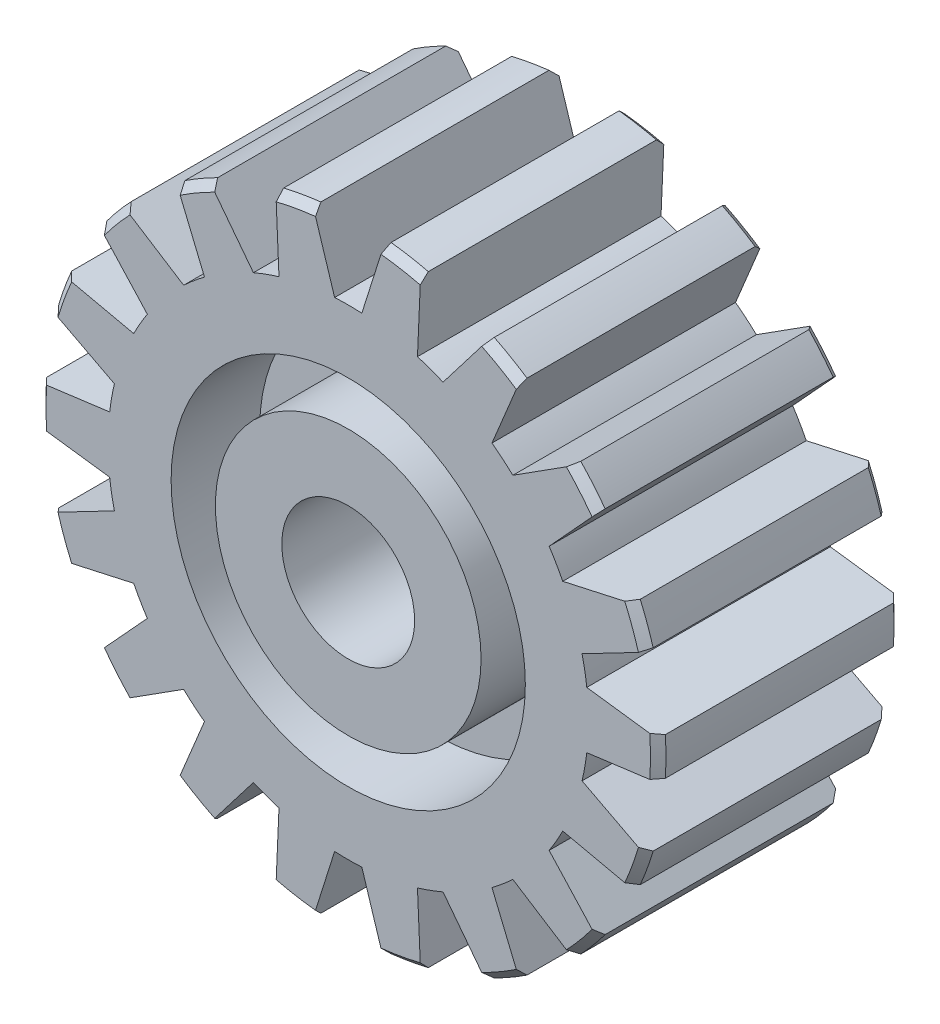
from build123d import *

# Parameters (mm, degrees)
ESQUISSE2_R            = 7
DIAM_TRE_DE_T_TE_DEPTH = 2.75
CHANFREINS_SIZE        = 0.175
CREUX_DENT_DEPTH       = 11.274361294
CREUX_DENT_DEPTH_BACK  = 11.274361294
R_P_TITION_COUNT       = 18
ESQUISSE4_R            = 1.5
PASSAGE_AXE_DEPTH      = 12.296998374
ESQUISSE5_R            = 4
ESQUISSE5_R_2          = 3
GORGE_DEPTH            = 2


with BuildPart() as part:
    # Esquisse2 → Diam_tre de t_te (new, symmetric)
    with BuildSketch(Plane.XY):
        Circle(ESQUISSE2_R)
    extrude(amount=DIAM_TRE_DE_T_TE_DEPTH, both=True)

    # Chanfreins
    chanfreins_edges = [part.edges().sort_by_distance(p)[0] for p in [
        (-7, 0, -2.75),
        (-7, 0, 2.75),
    ]]
    chamfer(chanfreins_edges, length=CHANFREINS_SIZE)

    # Esquisse3 → Creux dent (cut, two sides: drawn at the far end of the back side and taken through both)
    with BuildSketch(Plane.XY.offset(-CREUX_DENT_DEPTH_BACK)):
        with BuildLine():
            Line((-0.307200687, 5.416295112), (-0.792355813, 6.955010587))
            ThreePointArc((-0.792355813, 6.955010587), (0, 7), (0.792355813, 6.955010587))
            Line((0.792355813, 6.955010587), (0.307200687, 5.416295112))
            ThreePointArc((0.307200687, 5.416295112), (0, 5.425), (-0.307200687, 5.416295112))
        make_face()
    creux_dent = extrude(amount=CREUX_DENT_DEPTH + CREUX_DENT_DEPTH_BACK, mode=Mode.SUBTRACT)

    # R_p_tition: Creux dent ×18 about axis
    r_p_tition_axis = Axis((0, 0, 0), (0, 0, 1))
    for i in range(1, R_P_TITION_COUNT):
        add(creux_dent.rotate(r_p_tition_axis, i * 360 / R_P_TITION_COUNT), mode=Mode.SUBTRACT)

    # Esquisse4 → Passage axe (cut, through all)
    with BuildSketch(Plane.XY.offset(2.75)):
        Circle(ESQUISSE4_R)
    extrude(amount=-PASSAGE_AXE_DEPTH, mode=Mode.SUBTRACT)

    # Esquisse5 → Gorge (cut)
    with BuildSketch(Plane.XY.offset(2.75)):
        Circle(ESQUISSE5_R)
        Circle(ESQUISSE5_R_2, mode=Mode.SUBTRACT)
    gorge = extrude(amount=-GORGE_DEPTH, mode=Mode.SUBTRACT)

    # Sym_trie gorge: Gorge across plane
    add(gorge.mirror(Plane.XY), mode=Mode.SUBTRACT)


solid = part.part
